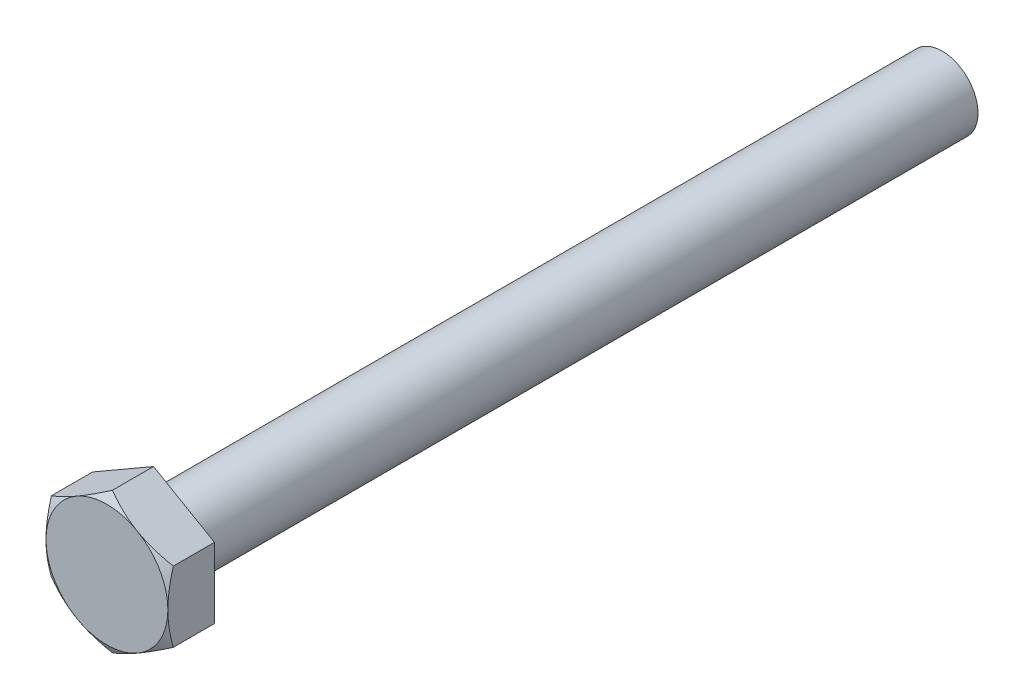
ISO-10303-21;
HEADER;
FILE_DESCRIPTION(('STEP AP214'),'2;1');
FILE_NAME('part.step','',(''),(''),'','','');
FILE_SCHEMA(('AUTOMOTIVE_DESIGN { 1 0 10303 214 1 1 1 1 }'));
ENDSEC;
DATA;
#1=APPLICATION_CONTEXT('core data for automotive mechanical design processes');
#2=APPLICATION_PROTOCOL_DEFINITION('international standard','automotive_design',2000,#1);
#3=PRODUCT_CONTEXT('',#1,'mechanical');
#4=PRODUCT('Part','Part','',(#3));
#5=PRODUCT_RELATED_PRODUCT_CATEGORY('part','',(#4));
#6=PRODUCT_DEFINITION_FORMATION('','',#4);
#7=PRODUCT_DEFINITION_CONTEXT('part definition',#1,'design');
#8=PRODUCT_DEFINITION('design','',#6,#7);
#9=PRODUCT_DEFINITION_SHAPE('','',#8);
#10=(LENGTH_UNIT() NAMED_UNIT(*) SI_UNIT(.MILLI.,.METRE.));
#11=(NAMED_UNIT(*) PLANE_ANGLE_UNIT() SI_UNIT($,.RADIAN.));
#12=(NAMED_UNIT(*) SI_UNIT($,.STERADIAN.) SOLID_ANGLE_UNIT());
#13=UNCERTAINTY_MEASURE_WITH_UNIT(LENGTH_MEASURE(1.E-05),#10,'distance_accuracy_value','');
#14=(GEOMETRIC_REPRESENTATION_CONTEXT(3) GLOBAL_UNCERTAINTY_ASSIGNED_CONTEXT((#13)) GLOBAL_UNIT_ASSIGNED_CONTEXT((#10,
#11,#12)) REPRESENTATION_CONTEXT('',''));
#15=CARTESIAN_POINT('',(0.,0.,0.));
#16=DIRECTION('',(0.,0.,1.));
#17=DIRECTION('',(1.,0.,0.));
#18=AXIS2_PLACEMENT_3D('',#15,#16,#17);
#19=CARTESIAN_POINT('',(0.,-19.6299091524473,123.));
#20=DIRECTION('',(-0.5,0.866025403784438,0.));
#21=DIRECTION('',(-0.866025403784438,-0.5,0.));
#22=AXIS2_PLACEMENT_3D('',#19,#20,#21);
#23=PLANE('',#22);
#24=CARTESIAN_POINT('',(-0.000200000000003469,-19.6300246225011,121.481554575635));
#25=CARTESIAN_POINT('',(0.373453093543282,-19.4142959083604,121.606097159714));
#26=CARTESIAN_POINT('',(0.748563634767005,-19.197725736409,121.724988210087));
#27=CARTESIAN_POINT('',(1.50179265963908,-18.7628487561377,121.949896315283));
#28=CARTESIAN_POINT('',(1.87991208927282,-18.5445414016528,122.055909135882));
#29=CARTESIAN_POINT('',(2.6398896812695,-18.1057681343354,122.253635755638));
#30=CARTESIAN_POINT('',(3.02175449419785,-17.8852983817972,122.345315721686));
#31=CARTESIAN_POINT('',(3.78813752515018,-17.4428269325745,122.512407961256));
#32=CARTESIAN_POINT('',(4.1726555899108,-17.2208253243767,122.587821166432));
#33=CARTESIAN_POINT('',(4.93449246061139,-16.7809786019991,122.719172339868));
#34=CARTESIAN_POINT('',(5.31175470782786,-16.5631661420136,122.775545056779));
#35=CARTESIAN_POINT('',(6.06800787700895,-16.1265431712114,122.870069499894));
#36=CARTESIAN_POINT('',(6.44699883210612,-15.9077326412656,122.908220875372));
#37=CARTESIAN_POINT('',(7.20561738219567,-15.4697440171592,122.965339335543));
#38=CARTESIAN_POINT('',(7.58524368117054,-15.2505666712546,122.984329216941));
#39=CARTESIAN_POINT('',(8.34484669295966,-14.8120096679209,123.002716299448));
#40=CARTESIAN_POINT('',(8.72482339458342,-14.5926300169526,123.002114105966));
#41=CARTESIAN_POINT('',(9.43519932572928,-14.1824942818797,122.982685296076));
#42=CARTESIAN_POINT('',(9.76564916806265,-13.9917089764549,122.96622784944));
#43=CARTESIAN_POINT('',(10.4257606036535,-13.6105934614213,122.918807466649));
#44=CARTESIAN_POINT('',(10.7554222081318,-13.4202632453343,122.887844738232));
#45=CARTESIAN_POINT('',(11.4138322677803,-13.0401300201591,122.811951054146));
#46=CARTESIAN_POINT('',(11.7425796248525,-12.8503276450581,122.76700746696));
#47=CARTESIAN_POINT('',(12.3985093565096,-12.4716264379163,122.663945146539));
#48=CARTESIAN_POINT('',(12.7256917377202,-12.2827276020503,122.605826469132));
#49=CARTESIAN_POINT('',(13.718896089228,-11.709300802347,122.410229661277));
#50=CARTESIAN_POINT('',(14.3820418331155,-11.3264334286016,122.253247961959));
#51=CARTESIAN_POINT('',(15.6984451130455,-10.5664076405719,121.89696389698));
#52=CARTESIAN_POINT('',(16.351719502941,-10.189239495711,121.697745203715));
#53=CARTESIAN_POINT('',(17.0002,-9.81483910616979,121.481554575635));
#54=B_SPLINE_CURVE_WITH_KNOTS('',3,(#24,#25,#26,#27,#28,#29,#30,#31,#32,#33,#34,#35,#36,#37,#38,
#39,#40,#41,#42,#43,#44,#45,#46,#47,#48,#49,#50,#51,#52,#53),.UNSPECIFIED.,.F.,.F.,(4,2,2,2,2,2,
2,2,2,2,2,2,2,2,4),(0.,1.34725361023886,2.6949489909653,4.04577911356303,5.3965318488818,
6.7139450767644,8.03138366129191,9.3472530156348,10.6630817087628,11.808581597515,
12.9540650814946,14.1005865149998,15.2471030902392,17.590639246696,19.929575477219),.UNSPECIFIED.);
#55=CARTESIAN_POINT('',(0.,-19.6299091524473,121.48162124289));
#56=VERTEX_POINT('',#55);
#57=CARTESIAN_POINT('',(8.50000000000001,-14.7224318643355,123.));
#58=VERTEX_POINT('',#57);
#59=EDGE_CURVE('E275',#56,#58,#54,.T.);
#60=ORIENTED_EDGE('',*,*,#59,.F.);
#61=DIRECTION('',(0.,0.,-1.));
#62=VECTOR('',#61,1.);
#63=CARTESIAN_POINT('',(0.,-19.6299091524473,123.));
#64=LINE('',#63,#62);
#65=CARTESIAN_POINT('',(0.,-19.6299091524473,110.));
#66=VERTEX_POINT('',#65);
#67=EDGE_CURVE('E258',#56,#66,#64,.T.);
#68=ORIENTED_EDGE('',*,*,#67,.T.);
#69=DIRECTION('',(0.866025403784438,0.5,0.));
#70=VECTOR('',#69,1.);
#71=CARTESIAN_POINT('',(0.,-19.6299091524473,110.));
#72=LINE('',#71,#70);
#73=CARTESIAN_POINT('',(17.,-9.81495457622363,110.));
#74=VERTEX_POINT('',#73);
#75=EDGE_CURVE('E273',#66,#74,#72,.T.);
#76=ORIENTED_EDGE('',*,*,#75,.T.);
#77=DIRECTION('',(0.,0.,-1.));
#78=VECTOR('',#77,1.);
#79=CARTESIAN_POINT('',(17.,-9.81495457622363,123.));
#80=LINE('',#79,#78);
#81=CARTESIAN_POINT('',(17.,-9.81495457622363,121.48162124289));
#82=VERTEX_POINT('',#81);
#83=EDGE_CURVE('E246',#82,#74,#80,.T.);
#84=ORIENTED_EDGE('',*,*,#83,.F.);
#85=EDGE_CURVE('E184',#58,#82,#54,.T.);
#86=ORIENTED_EDGE('',*,*,#85,.F.);
#87=EDGE_LOOP('',(#60,#68,#76,#84,#86));
#88=FACE_BOUND('',#87,.T.);
#89=ADVANCED_FACE('F55',(#88),#23,.F.);
#90=CARTESIAN_POINT('',(17.,-9.81495457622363,123.));
#91=DIRECTION('',(-1.,0.,0.));
#92=DIRECTION('',(0.,0.,1.));
#93=AXIS2_PLACEMENT_3D('',#90,#91,#92);
#94=PLANE('',#93);
#95=CARTESIAN_POINT('',(17.,-26.7280331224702,114.526636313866));
#96=CARTESIAN_POINT('',(17.,-26.3551833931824,114.708270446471));
#97=CARTESIAN_POINT('',(17.,-25.9819058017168,114.889025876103));
#98=CARTESIAN_POINT('',(17.,-25.2344057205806,115.248580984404));
#99=CARTESIAN_POINT('',(17.,-24.860183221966,115.427380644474));
#100=CARTESIAN_POINT('',(17.,-23.735869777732,115.960593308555));
#101=CARTESIAN_POINT('',(17.,-22.9842377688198,116.311768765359));
#102=CARTESIAN_POINT('',(17.,-21.4721452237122,117.005243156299));
#103=CARTESIAN_POINT('',(17.,-20.7116591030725,117.34748643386));
#104=CARTESIAN_POINT('',(17.,-19.1847639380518,118.018447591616));
#105=CARTESIAN_POINT('',(17.,-18.4183551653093,118.347166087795));
#106=CARTESIAN_POINT('',(17.,-16.8524945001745,118.998280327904));
#107=CARTESIAN_POINT('',(17.,-16.0527982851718,119.320091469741));
#108=CARTESIAN_POINT('',(17.,-14.4441803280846,119.940228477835));
#109=CARTESIAN_POINT('',(17.,-13.635257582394,120.23855176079));
#110=CARTESIAN_POINT('',(17.,-12.0083241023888,120.804143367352));
#111=CARTESIAN_POINT('',(17.,-11.1903343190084,121.071471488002));
#112=CARTESIAN_POINT('',(17.,-9.54255158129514,121.566753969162));
#113=CARTESIAN_POINT('',(17.,-8.71276231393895,121.794720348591));
#114=CARTESIAN_POINT('',(17.,-7.46131813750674,122.098467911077));
#115=CARTESIAN_POINT('',(17.,-7.04422239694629,122.193137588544));
#116=CARTESIAN_POINT('',(17.,-6.20711565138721,122.368644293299));
#117=CARTESIAN_POINT('',(17.,-5.78710470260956,122.449481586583));
#118=CARTESIAN_POINT('',(17.,-4.94443148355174,122.59591989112));
#119=CARTESIAN_POINT('',(17.,-4.52176927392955,122.661521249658));
#120=CARTESIAN_POINT('',(17.,-3.67421205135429,122.776193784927));
#121=CARTESIAN_POINT('',(17.,-3.24931713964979,122.825265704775));
#122=CARTESIAN_POINT('',(17.,-2.40359325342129,122.905268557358));
#123=CARTESIAN_POINT('',(17.,-1.98278671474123,122.936435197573));
#124=CARTESIAN_POINT('',(17.,-1.1402323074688,122.980929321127));
#125=CARTESIAN_POINT('',(17.,-0.718484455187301,122.994257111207));
#126=CARTESIAN_POINT('',(17.,0.125201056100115,123.00275460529));
#127=CARTESIAN_POINT('',(17.,0.547138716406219,122.997924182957));
#128=CARTESIAN_POINT('',(17.,1.39042569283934,122.970227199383));
#129=CARTESIAN_POINT('',(17.,1.81177498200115,122.947359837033));
#130=CARTESIAN_POINT('',(17.,2.81340815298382,122.872053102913));
#131=CARTESIAN_POINT('',(17.,3.39310826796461,122.811668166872));
#132=CARTESIAN_POINT('',(17.,4.54841596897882,122.659968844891));
#133=CARTESIAN_POINT('',(17.,5.12402303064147,122.568650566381));
#134=CARTESIAN_POINT('',(17.,6.84391206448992,122.253120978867));
#135=CARTESIAN_POINT('',(17.,7.98068827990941,121.987383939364));
#136=CARTESIAN_POINT('',(17.,9.68133337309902,121.523804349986));
#137=CARTESIAN_POINT('',(17.,10.2539418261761,121.35615677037));
#138=CARTESIAN_POINT('',(17.,11.393602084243,121.002767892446));
#139=CARTESIAN_POINT('',(17.,11.960653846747,120.817026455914));
#140=CARTESIAN_POINT('',(17.,13.0893763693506,120.430484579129));
#141=CARTESIAN_POINT('',(17.,13.6510486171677,120.229688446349));
#142=CARTESIAN_POINT('',(17.,14.4900257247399,119.919026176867));
#143=CARTESIAN_POINT('',(17.,14.7690947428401,119.813894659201));
#144=CARTESIAN_POINT('',(17.,15.3261263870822,119.600736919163));
#145=CARTESIAN_POINT('',(17.,15.6040890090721,119.492710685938));
#146=CARTESIAN_POINT('',(17.,16.3491524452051,119.199057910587));
#147=CARTESIAN_POINT('',(17.,16.8152948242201,119.010997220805));
#148=CARTESIAN_POINT('',(17.,17.7449138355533,118.628389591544));
#149=CARTESIAN_POINT('',(17.,18.2083904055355,118.433842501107));
#150=CARTESIAN_POINT('',(17.,19.5953089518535,117.841784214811));
#151=CARTESIAN_POINT('',(17.,20.5151724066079,117.43588285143));
#152=CARTESIAN_POINT('',(17.,22.3475546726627,116.607038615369));
#153=CARTESIAN_POINT('',(17.,23.260070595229,116.184089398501));
#154=CARTESIAN_POINT('',(17.,25.0788968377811,115.325172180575));
#155=CARTESIAN_POINT('',(17.,25.9852074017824,114.889204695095));
#156=CARTESIAN_POINT('',(17.,27.7942699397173,114.006378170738));
#157=CARTESIAN_POINT('',(17.,28.6970140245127,113.559503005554));
#158=CARTESIAN_POINT('',(17.,30.4984370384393,112.657627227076));
#159=CARTESIAN_POINT('',(17.,31.3971159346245,112.202626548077));
#160=CARTESIAN_POINT('',(17.,33.1909377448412,111.2861835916));
#161=CARTESIAN_POINT('',(17.,34.0860813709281,110.824742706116));
#162=CARTESIAN_POINT('',(17.,35.8735953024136,109.896531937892));
#163=CARTESIAN_POINT('',(17.,36.7659656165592,109.429762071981));
#164=CARTESIAN_POINT('',(17.,38.4550066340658,108.540964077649));
#165=CARTESIAN_POINT('',(17.,39.2519073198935,108.119372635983));
#166=CARTESIAN_POINT('',(17.,40.8441152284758,107.273190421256));
#167=CARTESIAN_POINT('',(17.,41.6394224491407,106.848599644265));
#168=CARTESIAN_POINT('',(17.,44.0233835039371,105.570947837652));
#169=CARTESIAN_POINT('',(17.,45.6099843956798,104.714056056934));
#170=CARTESIAN_POINT('',(17.,48.7737962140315,102.995511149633));
#171=CARTESIAN_POINT('',(17.,50.3510208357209,102.133883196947));
#172=CARTESIAN_POINT('',(17.,52.7143990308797,100.837107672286));
#173=CARTESIAN_POINT('',(17.,53.5017518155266,100.404143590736));
#174=CARTESIAN_POINT('',(17.,55.0757435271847,99.5369220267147));
#175=CARTESIAN_POINT('',(17.,55.8623824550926,99.1026645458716));
#176=CARTESIAN_POINT('',(17.,56.6487081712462,98.6678408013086));
#177=B_SPLINE_CURVE_WITH_KNOTS('',3,(#95,#96,#97,#98,#99,#100,#101,#102,#103,#104,#105,#106,
#107,#108,#109,#110,#111,#112,#113,#114,#115,#116,#117,#118,#119,#120,#121,#122,#123,#124,#125,
#126,#127,#128,#129,#130,#131,#132,#133,#134,#135,#136,#137,#138,#139,#140,#141,#142,#143,#144,
#145,#146,#147,#148,#149,#150,#151,#152,#153,#154,#155,#156,#157,#158,#159,#160,#161,#162,#163,
#164,#165,#166,#167,#168,#169,#170,#171,#172,#173,#174,#175,#176),.UNSPECIFIED.,.F.,.F.,(4,2,2,
2,2,2,2,2,2,2,2,2,2,2,2,2,2,2,2,2,2,2,2,2,2,2,2,2,2,2,2,2,2,2,2,2,2,2,2,2,4),(0.,
1.24421283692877,2.48843749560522,4.97723697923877,7.47897879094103,9.98060653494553,
12.5663811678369,15.1524398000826,17.7334232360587,20.3136171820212,21.5965386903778,
22.8794355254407,24.1623031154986,25.4451130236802,26.7106242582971,27.97611373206,
29.241612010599,30.507166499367,32.2546970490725,34.0024475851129,37.4996679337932,
39.2894449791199,41.0792356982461,42.8685162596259,43.7631470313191,44.6577811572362,
46.1656645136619,47.673582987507,50.6896374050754,53.7068247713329,56.7238928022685,
59.745729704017,62.767591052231,65.7888090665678,68.8100175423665,71.5146563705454,
74.2192987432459,79.6288966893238,85.0205755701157,87.7162081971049,90.4118374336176),.UNSPECIFIED.);
#178=CARTESIAN_POINT('',(17.,0.,123.));
#179=VERTEX_POINT('',#178);
#180=EDGE_CURVE('E278',#82,#179,#177,.T.);
#181=ORIENTED_EDGE('',*,*,#180,.F.);
#182=ORIENTED_EDGE('',*,*,#83,.T.);
#183=DIRECTION('',(0.,1.,0.));
#184=VECTOR('',#183,1.);
#185=CARTESIAN_POINT('',(17.,-9.81495457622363,110.));
#186=LINE('',#185,#184);
#187=CARTESIAN_POINT('',(17.,9.81495457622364,110.));
#188=VERTEX_POINT('',#187);
#189=EDGE_CURVE('E271',#74,#188,#186,.T.);
#190=ORIENTED_EDGE('',*,*,#189,.T.);
#191=DIRECTION('',(0.,0.,-1.));
#192=VECTOR('',#191,1.);
#193=CARTESIAN_POINT('',(17.,9.81495457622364,123.));
#194=LINE('',#193,#192);
#195=CARTESIAN_POINT('',(17.,9.81495457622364,121.48162124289));
#196=VERTEX_POINT('',#195);
#197=EDGE_CURVE('E249',#196,#188,#194,.T.);
#198=ORIENTED_EDGE('',*,*,#197,.F.);
#199=EDGE_CURVE('E131',#179,#196,#177,.T.);
#200=ORIENTED_EDGE('',*,*,#199,.F.);
#201=EDGE_LOOP('',(#181,#182,#190,#198,#200));
#202=FACE_BOUND('',#201,.T.);
#203=ADVANCED_FACE('F221',(#202),#94,.F.);
#204=CARTESIAN_POINT('',(17.,9.81495457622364,123.));
#205=DIRECTION('',(-0.5,-0.866025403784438,0.));
#206=DIRECTION('',(0.866025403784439,-0.5,0.));
#207=AXIS2_PLACEMENT_3D('',#204,#205,#206);
#208=PLANE('',#207);
#209=CARTESIAN_POINT('',(17.0002,9.8148391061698,121.481554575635));
#210=CARTESIAN_POINT('',(16.6265469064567,10.0305678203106,121.606097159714));
#211=CARTESIAN_POINT('',(16.251436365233,10.2471379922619,121.724988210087));
#212=CARTESIAN_POINT('',(15.4982073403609,10.6820149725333,121.949896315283));
#213=CARTESIAN_POINT('',(15.1200879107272,10.9003223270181,122.055909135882));
#214=CARTESIAN_POINT('',(14.3601103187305,11.3390955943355,122.253635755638));
#215=CARTESIAN_POINT('',(13.9782455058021,11.5595653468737,122.345315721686));
#216=CARTESIAN_POINT('',(13.2118624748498,12.0020367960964,122.512407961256));
#217=CARTESIAN_POINT('',(12.8273444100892,12.2240384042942,122.587821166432));
#218=CARTESIAN_POINT('',(12.0655075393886,12.6638851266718,122.719172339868));
#219=CARTESIAN_POINT('',(11.6882452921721,12.8816975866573,122.775545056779));
#220=CARTESIAN_POINT('',(10.931992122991,13.3183205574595,122.870069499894));
#221=CARTESIAN_POINT('',(10.5530011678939,13.5371310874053,122.908220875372));
#222=CARTESIAN_POINT('',(9.79438261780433,13.9751197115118,122.965339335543));
#223=CARTESIAN_POINT('',(9.41475631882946,14.1942970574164,122.984329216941));
#224=CARTESIAN_POINT('',(8.65515330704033,14.6328540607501,123.002716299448));
#225=CARTESIAN_POINT('',(8.27517660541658,14.8522337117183,123.002114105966));
#226=CARTESIAN_POINT('',(7.56480067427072,15.2623694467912,122.982685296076));
#227=CARTESIAN_POINT('',(7.23435083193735,15.4531547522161,122.96622784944));
#228=CARTESIAN_POINT('',(6.57423939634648,15.8342702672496,122.918807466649));
#229=CARTESIAN_POINT('',(6.2445777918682,16.0246004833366,122.887844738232));
#230=CARTESIAN_POINT('',(5.58616773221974,16.4047337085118,122.811951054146));
#231=CARTESIAN_POINT('',(5.25742037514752,16.5945360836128,122.76700746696));
#232=CARTESIAN_POINT('',(4.60149064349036,16.9732372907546,122.663945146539));
#233=CARTESIAN_POINT('',(4.27430826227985,17.1621361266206,122.605826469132));
#234=CARTESIAN_POINT('',(3.281103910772,17.7355629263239,122.410229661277));
#235=CARTESIAN_POINT('',(2.61795816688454,18.1184303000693,122.253247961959));
#236=CARTESIAN_POINT('',(1.30155488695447,18.878456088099,121.89696389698));
#237=CARTESIAN_POINT('',(0.648280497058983,19.2556242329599,121.697745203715));
#238=CARTESIAN_POINT('',(-0.000199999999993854,19.6300246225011,121.481554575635));
#239=B_SPLINE_CURVE_WITH_KNOTS('',3,(#209,#210,#211,#212,#213,#214,#215,#216,#217,#218,#219,
#220,#221,#222,#223,#224,#225,#226,#227,#228,#229,#230,#231,#232,#233,#234,#235,#236,#237,#238),
.UNSPECIFIED.,.F.,.F.,(4,2,2,2,2,2,2,2,2,2,2,2,2,2,4),(0.,1.34725361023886,2.6949489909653,
4.04577911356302,5.39653184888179,6.71394507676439,8.03138366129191,9.3472530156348,
10.6630817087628,11.808581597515,12.9540650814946,14.1005865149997,15.2471030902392,
17.590639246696,19.929575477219),.UNSPECIFIED.);
#240=CARTESIAN_POINT('',(8.5,14.7224318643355,123.));
#241=VERTEX_POINT('',#240);
#242=EDGE_CURVE('E127',#196,#241,#239,.T.);
#243=ORIENTED_EDGE('',*,*,#242,.F.);
#244=ORIENTED_EDGE('',*,*,#197,.T.);
#245=DIRECTION('',(-0.866025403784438,0.5,0.));
#246=VECTOR('',#245,1.);
#247=CARTESIAN_POINT('',(17.,9.81495457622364,110.));
#248=LINE('',#247,#246);
#249=CARTESIAN_POINT('',(0.,19.6299091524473,110.));
#250=VERTEX_POINT('',#249);
#251=EDGE_CURVE('E269',#188,#250,#248,.T.);
#252=ORIENTED_EDGE('',*,*,#251,.T.);
#253=DIRECTION('',(0.,0.,-1.));
#254=VECTOR('',#253,1.);
#255=CARTESIAN_POINT('',(0.,19.6299091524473,123.));
#256=LINE('',#255,#254);
#257=CARTESIAN_POINT('',(0.,19.6299091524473,121.48162124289));
#258=VERTEX_POINT('',#257);
#259=EDGE_CURVE('E151',#258,#250,#256,.T.);
#260=ORIENTED_EDGE('',*,*,#259,.F.);
#261=EDGE_CURVE('E135',#241,#258,#239,.T.);
#262=ORIENTED_EDGE('',*,*,#261,.F.);
#263=EDGE_LOOP('',(#243,#244,#252,#260,#262));
#264=FACE_BOUND('',#263,.T.);
#265=ADVANCED_FACE('F149',(#264),#208,.F.);
#266=CARTESIAN_POINT('',(0.,19.6299091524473,123.));
#267=DIRECTION('',(0.5,-0.866025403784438,0.));
#268=DIRECTION('',(0.866025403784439,0.5,0.));
#269=AXIS2_PLACEMENT_3D('',#266,#267,#268);
#270=PLANE('',#269);
#271=CARTESIAN_POINT('',(0.000200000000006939,19.6300246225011,121.481554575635));
#272=CARTESIAN_POINT('',(-0.37345309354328,19.4142959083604,121.606097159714));
#273=CARTESIAN_POINT('',(-0.748563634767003,19.197725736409,121.724988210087));
#274=CARTESIAN_POINT('',(-1.50179265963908,18.7628487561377,121.949896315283));
#275=CARTESIAN_POINT('',(-1.87991208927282,18.5445414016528,122.055909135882));
#276=CARTESIAN_POINT('',(-2.6398896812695,18.1057681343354,122.253635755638));
#277=CARTESIAN_POINT('',(-3.02175449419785,17.8852983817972,122.345315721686));
#278=CARTESIAN_POINT('',(-3.78813752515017,17.4428269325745,122.512407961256));
#279=CARTESIAN_POINT('',(-4.17265558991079,17.2208253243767,122.587821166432));
#280=CARTESIAN_POINT('',(-4.93449246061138,16.7809786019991,122.719172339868));
#281=CARTESIAN_POINT('',(-5.31175470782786,16.5631661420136,122.77554505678));
#282=CARTESIAN_POINT('',(-6.06800787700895,16.1265431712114,122.870069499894));
#283=CARTESIAN_POINT('',(-6.44699883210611,15.9077326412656,122.908220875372));
#284=CARTESIAN_POINT('',(-7.20561738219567,15.4697440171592,122.965339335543));
#285=CARTESIAN_POINT('',(-7.58524368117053,15.2505666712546,122.984329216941));
#286=CARTESIAN_POINT('',(-8.34484669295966,14.8120096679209,123.002716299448));
#287=CARTESIAN_POINT('',(-8.72482339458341,14.5926300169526,123.002114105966));
#288=CARTESIAN_POINT('',(-9.43519932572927,14.1824942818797,122.982685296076));
#289=CARTESIAN_POINT('',(-9.76564916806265,13.9917089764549,122.96622784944));
#290=CARTESIAN_POINT('',(-10.4257606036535,13.6105934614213,122.918807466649));
#291=CARTESIAN_POINT('',(-10.7554222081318,13.4202632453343,122.887844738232));
#292=CARTESIAN_POINT('',(-11.4138322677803,13.0401300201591,122.811951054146));
#293=CARTESIAN_POINT('',(-11.7425796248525,12.8503276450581,122.76700746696));
#294=CARTESIAN_POINT('',(-12.3985093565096,12.4716264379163,122.663945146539));
#295=CARTESIAN_POINT('',(-12.7256917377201,12.2827276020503,122.605826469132));
#296=CARTESIAN_POINT('',(-13.718896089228,11.709300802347,122.410229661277));
#297=CARTESIAN_POINT('',(-14.3820418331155,11.3264334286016,122.253247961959));
#298=CARTESIAN_POINT('',(-15.6984451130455,10.5664076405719,121.89696389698));
#299=CARTESIAN_POINT('',(-16.351719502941,10.189239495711,121.697745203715));
#300=CARTESIAN_POINT('',(-17.0002,9.81483910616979,121.481554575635));
#301=B_SPLINE_CURVE_WITH_KNOTS('',3,(#271,#272,#273,#274,#275,#276,#277,#278,#279,#280,#281,
#282,#283,#284,#285,#286,#287,#288,#289,#290,#291,#292,#293,#294,#295,#296,#297,#298,#299,#300),
.UNSPECIFIED.,.F.,.F.,(4,2,2,2,2,2,2,2,2,2,2,2,2,2,4),(0.,1.34725361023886,2.6949489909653,
4.04577911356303,5.3965318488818,6.71394507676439,8.03138366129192,9.3472530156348,
10.6630817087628,11.808581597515,12.9540650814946,14.1005865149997,15.2471030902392,
17.590639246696,19.929575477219),.UNSPECIFIED.);
#302=CARTESIAN_POINT('',(-8.50000000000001,14.7224318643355,123.));
#303=VERTEX_POINT('',#302);
#304=EDGE_CURVE('E140',#258,#303,#301,.T.);
#305=ORIENTED_EDGE('',*,*,#304,.F.);
#306=ORIENTED_EDGE('',*,*,#259,.T.);
#307=DIRECTION('',(-0.866025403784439,-0.5,0.));
#308=VECTOR('',#307,1.);
#309=CARTESIAN_POINT('',(0.,19.6299091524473,110.));
#310=LINE('',#309,#308);
#311=CARTESIAN_POINT('',(-17.,9.81495457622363,110.));
#312=VERTEX_POINT('',#311);
#313=EDGE_CURVE('E266',#250,#312,#310,.T.);
#314=ORIENTED_EDGE('',*,*,#313,.T.);
#315=DIRECTION('',(0.,0.,-1.));
#316=VECTOR('',#315,1.);
#317=CARTESIAN_POINT('',(-17.,9.81495457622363,123.));
#318=LINE('',#317,#316);
#319=CARTESIAN_POINT('',(-17.,9.81495457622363,121.48162124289));
#320=VERTEX_POINT('',#319);
#321=EDGE_CURVE('E254',#320,#312,#318,.T.);
#322=ORIENTED_EDGE('',*,*,#321,.F.);
#323=EDGE_CURVE('E152',#303,#320,#301,.T.);
#324=ORIENTED_EDGE('',*,*,#323,.F.);
#325=EDGE_LOOP('',(#305,#306,#314,#322,#324));
#326=FACE_BOUND('',#325,.T.);
#327=ADVANCED_FACE('F212',(#326),#270,.F.);
#328=CARTESIAN_POINT('',(-17.,9.81495457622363,123.));
#329=DIRECTION('',(1.,0.,0.));
#330=DIRECTION('',(0.,1.,0.));
#331=AXIS2_PLACEMENT_3D('',#328,#329,#330);
#332=PLANE('',#331);
#333=CARTESIAN_POINT('',(-17.,-26.7280331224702,114.526636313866));
#334=CARTESIAN_POINT('',(-17.,-26.3551833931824,114.708270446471));
#335=CARTESIAN_POINT('',(-17.,-25.9819058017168,114.889025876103));
#336=CARTESIAN_POINT('',(-17.,-25.2344057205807,115.248580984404));
#337=CARTESIAN_POINT('',(-17.,-24.860183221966,115.427380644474));
#338=CARTESIAN_POINT('',(-17.,-23.735869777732,115.960593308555));
#339=CARTESIAN_POINT('',(-17.,-22.9842377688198,116.311768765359));
#340=CARTESIAN_POINT('',(-17.,-21.4721452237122,117.005243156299));
#341=CARTESIAN_POINT('',(-17.,-20.7116591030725,117.347486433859));
#342=CARTESIAN_POINT('',(-17.,-19.1847639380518,118.018447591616));
#343=CARTESIAN_POINT('',(-17.,-18.4183551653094,118.347166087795));
#344=CARTESIAN_POINT('',(-17.,-16.8524945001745,118.998280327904));
#345=CARTESIAN_POINT('',(-17.,-16.0527982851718,119.320091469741));
#346=CARTESIAN_POINT('',(-17.,-14.4441803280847,119.940228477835));
#347=CARTESIAN_POINT('',(-17.,-13.635257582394,120.23855176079));
#348=CARTESIAN_POINT('',(-17.,-12.0083241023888,120.804143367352));
#349=CARTESIAN_POINT('',(-17.,-11.1903343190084,121.071471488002));
#350=CARTESIAN_POINT('',(-17.,-9.54255158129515,121.566753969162));
#351=CARTESIAN_POINT('',(-17.,-8.71276231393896,121.794720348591));
#352=CARTESIAN_POINT('',(-17.,-7.46131813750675,122.098467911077));
#353=CARTESIAN_POINT('',(-17.,-7.04422239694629,122.193137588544));
#354=CARTESIAN_POINT('',(-17.,-6.20711565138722,122.368644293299));
#355=CARTESIAN_POINT('',(-17.,-5.78710470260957,122.449481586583));
#356=CARTESIAN_POINT('',(-17.,-4.94443148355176,122.59591989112));
#357=CARTESIAN_POINT('',(-17.,-4.52176927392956,122.661521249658));
#358=CARTESIAN_POINT('',(-17.,-3.67421205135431,122.776193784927));
#359=CARTESIAN_POINT('',(-17.,-3.2493171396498,122.825265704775));
#360=CARTESIAN_POINT('',(-17.,-2.40359325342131,122.905268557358));
#361=CARTESIAN_POINT('',(-17.,-1.98278671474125,122.936435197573));
#362=CARTESIAN_POINT('',(-17.,-1.14023230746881,122.980929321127));
#363=CARTESIAN_POINT('',(-17.,-0.718484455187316,122.994257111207));
#364=CARTESIAN_POINT('',(-17.,0.125201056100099,123.00275460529));
#365=CARTESIAN_POINT('',(-17.,0.547138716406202,122.997924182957));
#366=CARTESIAN_POINT('',(-17.,1.39042569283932,122.970227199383));
#367=CARTESIAN_POINT('',(-17.,1.81177498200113,122.947359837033));
#368=CARTESIAN_POINT('',(-17.,2.8134081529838,122.872053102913));
#369=CARTESIAN_POINT('',(-17.,3.39310826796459,122.811668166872));
#370=CARTESIAN_POINT('',(-17.,4.5484159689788,122.659968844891));
#371=CARTESIAN_POINT('',(-17.,5.12402303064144,122.568650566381));
#372=CARTESIAN_POINT('',(-17.,6.84391206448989,122.253120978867));
#373=CARTESIAN_POINT('',(-17.,7.98068827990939,121.987383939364));
#374=CARTESIAN_POINT('',(-17.,9.68133337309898,121.523804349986));
#375=CARTESIAN_POINT('',(-17.,10.2539418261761,121.35615677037));
#376=CARTESIAN_POINT('',(-17.,11.393602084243,121.002767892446));
#377=CARTESIAN_POINT('',(-17.,11.9606538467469,120.817026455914));
#378=CARTESIAN_POINT('',(-17.,13.0893763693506,120.430484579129));
#379=CARTESIAN_POINT('',(-17.,13.6510486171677,120.229688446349));
#380=CARTESIAN_POINT('',(-17.,14.4900257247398,119.919026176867));
#381=CARTESIAN_POINT('',(-17.,14.76909474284,119.813894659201));
#382=CARTESIAN_POINT('',(-17.,15.3261263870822,119.600736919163));
#383=CARTESIAN_POINT('',(-17.,15.6040890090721,119.492710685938));
#384=CARTESIAN_POINT('',(-17.,16.3491524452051,119.199057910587));
#385=CARTESIAN_POINT('',(-17.,16.8152948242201,119.010997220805));
#386=CARTESIAN_POINT('',(-17.,17.7449138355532,118.628389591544));
#387=CARTESIAN_POINT('',(-17.,18.2083904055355,118.433842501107));
#388=CARTESIAN_POINT('',(-17.,19.5953089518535,117.841784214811));
#389=CARTESIAN_POINT('',(-17.,20.5151724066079,117.43588285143));
#390=CARTESIAN_POINT('',(-17.,22.3475546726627,116.607038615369));
#391=CARTESIAN_POINT('',(-17.,23.2600705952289,116.184089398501));
#392=CARTESIAN_POINT('',(-17.,25.078896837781,115.325172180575));
#393=CARTESIAN_POINT('',(-17.,25.9852074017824,114.889204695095));
#394=CARTESIAN_POINT('',(-17.,27.7942699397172,114.006378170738));
#395=CARTESIAN_POINT('',(-17.,28.6970140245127,113.559503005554));
#396=CARTESIAN_POINT('',(-17.,30.4984370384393,112.657627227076));
#397=CARTESIAN_POINT('',(-17.,31.3971159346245,112.202626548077));
#398=CARTESIAN_POINT('',(-17.,33.1909377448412,111.2861835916));
#399=CARTESIAN_POINT('',(-17.,34.0860813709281,110.824742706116));
#400=CARTESIAN_POINT('',(-17.,35.8735953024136,109.896531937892));
#401=CARTESIAN_POINT('',(-17.,36.7659656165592,109.429762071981));
#402=CARTESIAN_POINT('',(-17.,38.4550066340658,108.540964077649));
#403=CARTESIAN_POINT('',(-17.,39.2519073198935,108.119372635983));
#404=CARTESIAN_POINT('',(-17.,40.8441152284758,107.273190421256));
#405=CARTESIAN_POINT('',(-17.,41.6394224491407,106.848599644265));
#406=CARTESIAN_POINT('',(-17.,44.0233835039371,105.570947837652));
#407=CARTESIAN_POINT('',(-17.,45.6099843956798,104.714056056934));
#408=CARTESIAN_POINT('',(-17.,48.7737962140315,102.995511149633));
#409=CARTESIAN_POINT('',(-17.,50.3510208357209,102.133883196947));
#410=CARTESIAN_POINT('',(-17.,52.7143990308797,100.837107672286));
#411=CARTESIAN_POINT('',(-17.,53.5017518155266,100.404143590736));
#412=CARTESIAN_POINT('',(-17.,55.0757435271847,99.5369220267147));
#413=CARTESIAN_POINT('',(-17.,55.8623824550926,99.1026645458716));
#414=CARTESIAN_POINT('',(-17.,56.6487081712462,98.6678408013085));
#415=B_SPLINE_CURVE_WITH_KNOTS('',3,(#333,#334,#335,#336,#337,#338,#339,#340,#341,#342,#343,
#344,#345,#346,#347,#348,#349,#350,#351,#352,#353,#354,#355,#356,#357,#358,#359,#360,#361,#362,
#363,#364,#365,#366,#367,#368,#369,#370,#371,#372,#373,#374,#375,#376,#377,#378,#379,#380,#381,
#382,#383,#384,#385,#386,#387,#388,#389,#390,#391,#392,#393,#394,#395,#396,#397,#398,#399,#400,
#401,#402,#403,#404,#405,#406,#407,#408,#409,#410,#411,#412,#413,#414),.UNSPECIFIED.,.F.,.F.,(4,
2,2,2,2,2,2,2,2,2,2,2,2,2,2,2,2,2,2,2,2,2,2,2,2,2,2,2,2,2,2,2,2,2,2,2,2,2,2,2,4),(0.,
1.24421283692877,2.48843749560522,4.97723697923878,7.47897879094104,9.98060653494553,
12.5663811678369,15.1524398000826,17.7334232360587,20.3136171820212,21.5965386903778,
22.8794355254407,24.1623031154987,25.4451130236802,26.7106242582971,27.97611373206,
29.241612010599,30.507166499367,32.2546970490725,34.0024475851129,37.4996679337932,
39.2894449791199,41.0792356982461,42.8685162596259,43.7631470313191,44.6577811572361,
46.1656645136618,47.673582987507,50.6896374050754,53.7068247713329,56.7238928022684,
59.7457297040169,62.767591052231,65.7888090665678,68.8100175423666,71.5146563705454,
74.2192987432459,79.6288966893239,85.0205755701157,87.7162081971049,90.4118374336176),.UNSPECIFIED.);
#416=CARTESIAN_POINT('',(-17.,0.,123.));
#417=VERTEX_POINT('',#416);
#418=EDGE_CURVE('E206',#320,#417,#415,.F.);
#419=ORIENTED_EDGE('',*,*,#418,.F.);
#420=ORIENTED_EDGE('',*,*,#321,.T.);
#421=DIRECTION('',(0.,-1.,0.));
#422=VECTOR('',#421,1.);
#423=CARTESIAN_POINT('',(-17.,9.81495457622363,110.));
#424=LINE('',#423,#422);
#425=CARTESIAN_POINT('',(-17.,-9.81495457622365,110.));
#426=VERTEX_POINT('',#425);
#427=EDGE_CURVE('E263',#312,#426,#424,.T.);
#428=ORIENTED_EDGE('',*,*,#427,.T.);
#429=DIRECTION('',(0.,0.,-1.));
#430=VECTOR('',#429,1.);
#431=CARTESIAN_POINT('',(-17.,-9.81495457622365,123.));
#432=LINE('',#431,#430);
#433=CARTESIAN_POINT('',(-17.,-9.81495457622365,121.48162124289));
#434=VERTEX_POINT('',#433);
#435=EDGE_CURVE('E256',#434,#426,#432,.T.);
#436=ORIENTED_EDGE('',*,*,#435,.F.);
#437=EDGE_CURVE('E200',#417,#434,#415,.F.);
#438=ORIENTED_EDGE('',*,*,#437,.F.);
#439=EDGE_LOOP('',(#419,#420,#428,#436,#438));
#440=FACE_BOUND('',#439,.T.);
#441=ADVANCED_FACE('F208',(#440),#332,.F.);
#442=CARTESIAN_POINT('',(-17.,-9.81495457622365,123.));
#443=DIRECTION('',(0.5,0.866025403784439,0.));
#444=DIRECTION('',(-0.866025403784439,0.5,0.));
#445=AXIS2_PLACEMENT_3D('',#442,#443,#444);
#446=PLANE('',#445);
#447=CARTESIAN_POINT('',(-17.0002,-9.81483910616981,121.481554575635));
#448=CARTESIAN_POINT('',(-16.6265469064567,-10.0305678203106,121.606097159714));
#449=CARTESIAN_POINT('',(-16.251436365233,-10.2471379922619,121.724988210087));
#450=CARTESIAN_POINT('',(-15.4982073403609,-10.6820149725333,121.949896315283));
#451=CARTESIAN_POINT('',(-15.1200879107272,-10.9003223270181,122.055909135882));
#452=CARTESIAN_POINT('',(-14.3601103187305,-11.3390955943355,122.253635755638));
#453=CARTESIAN_POINT('',(-13.9782455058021,-11.5595653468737,122.345315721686));
#454=CARTESIAN_POINT('',(-13.2118624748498,-12.0020367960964,122.512407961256));
#455=CARTESIAN_POINT('',(-12.8273444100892,-12.2240384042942,122.587821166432));
#456=CARTESIAN_POINT('',(-12.0655075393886,-12.6638851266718,122.719172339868));
#457=CARTESIAN_POINT('',(-11.6882452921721,-12.8816975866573,122.775545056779));
#458=CARTESIAN_POINT('',(-10.931992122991,-13.3183205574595,122.870069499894));
#459=CARTESIAN_POINT('',(-10.5530011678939,-13.5371310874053,122.908220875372));
#460=CARTESIAN_POINT('',(-9.79438261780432,-13.9751197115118,122.965339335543));
#461=CARTESIAN_POINT('',(-9.41475631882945,-14.1942970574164,122.984329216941));
#462=CARTESIAN_POINT('',(-8.65515330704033,-14.6328540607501,123.002716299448));
#463=CARTESIAN_POINT('',(-8.27517660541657,-14.8522337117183,123.002114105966));
#464=CARTESIAN_POINT('',(-7.56480067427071,-15.2623694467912,122.982685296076));
#465=CARTESIAN_POINT('',(-7.23435083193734,-15.4531547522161,122.96622784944));
#466=CARTESIAN_POINT('',(-6.57423939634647,-15.8342702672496,122.918807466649));
#467=CARTESIAN_POINT('',(-6.24457779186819,-16.0246004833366,122.887844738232));
#468=CARTESIAN_POINT('',(-5.58616773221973,-16.4047337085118,122.811951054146));
#469=CARTESIAN_POINT('',(-5.25742037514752,-16.5945360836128,122.76700746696));
#470=CARTESIAN_POINT('',(-4.60149064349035,-16.9732372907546,122.663945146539));
#471=CARTESIAN_POINT('',(-4.27430826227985,-17.1621361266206,122.605826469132));
#472=CARTESIAN_POINT('',(-3.281103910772,-17.7355629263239,122.410229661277));
#473=CARTESIAN_POINT('',(-2.61795816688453,-18.1184303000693,122.253247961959));
#474=CARTESIAN_POINT('',(-1.30155488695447,-18.878456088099,121.89696389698));
#475=CARTESIAN_POINT('',(-0.64828049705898,-19.2556242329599,121.697745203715));
#476=CARTESIAN_POINT('',(0.00019999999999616,-19.6300246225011,121.481554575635));
#477=B_SPLINE_CURVE_WITH_KNOTS('',3,(#447,#448,#449,#450,#451,#452,#453,#454,#455,#456,#457,
#458,#459,#460,#461,#462,#463,#464,#465,#466,#467,#468,#469,#470,#471,#472,#473,#474,#475,#476),
.UNSPECIFIED.,.F.,.F.,(4,2,2,2,2,2,2,2,2,2,2,2,2,2,4),(0.,1.34725361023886,2.6949489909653,
4.04577911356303,5.39653184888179,6.71394507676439,8.03138366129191,9.3472530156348,
10.6630817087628,11.808581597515,12.9540650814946,14.1005865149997,15.2471030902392,
17.590639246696,19.929575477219),.UNSPECIFIED.);
#478=CARTESIAN_POINT('',(-8.5,-14.7224318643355,123.));
#479=VERTEX_POINT('',#478);
#480=EDGE_CURVE('E207',#434,#479,#477,.T.);
#481=ORIENTED_EDGE('',*,*,#480,.F.);
#482=ORIENTED_EDGE('',*,*,#435,.T.);
#483=DIRECTION('',(0.866025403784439,-0.5,0.));
#484=VECTOR('',#483,1.);
#485=CARTESIAN_POINT('',(-17.,-9.81495457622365,110.));
#486=LINE('',#485,#484);
#487=EDGE_CURVE('E260',#426,#66,#486,.T.);
#488=ORIENTED_EDGE('',*,*,#487,.T.);
#489=ORIENTED_EDGE('',*,*,#67,.F.);
#490=EDGE_CURVE('E146',#479,#56,#477,.T.);
#491=ORIENTED_EDGE('',*,*,#490,.F.);
#492=EDGE_LOOP('',(#481,#482,#488,#489,#491));
#493=FACE_BOUND('',#492,.T.);
#494=ADVANCED_FACE('F211',(#493),#446,.F.);
#495=CARTESIAN_POINT('',(0.,0.,110.));
#496=DIRECTION('',(0.,0.,-1.));
#497=DIRECTION('',(-1.,0.,0.));
#498=AXIS2_PLACEMENT_3D('',#495,#496,#497);
#499=CYLINDRICAL_SURFACE('',#498,10.);
#500=CARTESIAN_POINT('',(0.,0.,110.));
#501=DIRECTION('',(0.,0.,1.));
#502=DIRECTION('',(1.,0.,0.));
#503=AXIS2_PLACEMENT_3D('',#500,#501,#502);
#504=CIRCLE('',#503,10.);
#505=CARTESIAN_POINT('',(10.,0.,110.));
#506=VERTEX_POINT('',#505);
#507=EDGE_CURVE('E245',#506,#506,#504,.T.);
#508=ORIENTED_EDGE('',*,*,#507,.F.);
#509=EDGE_LOOP('',(#508));
#510=FACE_BOUND('',#509,.T.);
#511=CARTESIAN_POINT('',(0.,0.,-110.));
#512=DIRECTION('',(0.,0.,1.));
#513=DIRECTION('',(1.,0.,0.));
#514=AXIS2_PLACEMENT_3D('',#511,#512,#513);
#515=CIRCLE('',#514,10.);
#516=CARTESIAN_POINT('',(10.,0.,-110.));
#517=VERTEX_POINT('',#516);
#518=EDGE_CURVE('E243',#517,#517,#515,.T.);
#519=ORIENTED_EDGE('',*,*,#518,.T.);
#520=EDGE_LOOP('',(#519));
#521=FACE_BOUND('',#520,.T.);
#522=ADVANCED_FACE('F57',(#510,#521),#499,.T.);
#523=CARTESIAN_POINT('',(0.,0.,-110.));
#524=DIRECTION('',(0.,0.,1.));
#525=DIRECTION('',(1.,0.,0.));
#526=AXIS2_PLACEMENT_3D('',#523,#524,#525);
#527=PLANE('',#526);
#528=ORIENTED_EDGE('',*,*,#518,.F.);
#529=EDGE_LOOP('',(#528));
#530=FACE_BOUND('',#529,.T.);
#531=ADVANCED_FACE('F231',(#530),#527,.F.);
#532=CARTESIAN_POINT('',(0.,0.,110.));
#533=DIRECTION('',(0.,0.,1.));
#534=DIRECTION('',(1.,0.,0.));
#535=AXIS2_PLACEMENT_3D('',#532,#533,#534);
#536=PLANE('',#535);
#537=ORIENTED_EDGE('',*,*,#507,.T.);
#538=EDGE_LOOP('',(#537));
#539=FACE_BOUND('',#538,.T.);
#540=ORIENTED_EDGE('',*,*,#75,.F.);
#541=ORIENTED_EDGE('',*,*,#487,.F.);
#542=ORIENTED_EDGE('',*,*,#427,.F.);
#543=ORIENTED_EDGE('',*,*,#313,.F.);
#544=ORIENTED_EDGE('',*,*,#251,.F.);
#545=ORIENTED_EDGE('',*,*,#189,.F.);
#546=EDGE_LOOP('',(#540,#541,#542,#543,#544,#545));
#547=FACE_BOUND('',#546,.T.);
#548=ADVANCED_FACE('F233',(#539,#547),#536,.F.);
#549=CARTESIAN_POINT('',(0.,0.,123.));
#550=DIRECTION('',(0.,0.,-1.));
#551=DIRECTION('',(1.,0.,0.));
#552=AXIS2_PLACEMENT_3D('',#549,#550,#551);
#553=CONICAL_SURFACE('',#552,17.,1.0471975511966);
#554=ORIENTED_EDGE('',*,*,#85,.T.);
#555=ORIENTED_EDGE('',*,*,#180,.T.);
#556=CARTESIAN_POINT('',(0.,0.,123.));
#557=DIRECTION('',(0.,0.,1.));
#558=DIRECTION('',(1.,0.,0.));
#559=AXIS2_PLACEMENT_3D('',#556,#557,#558);
#560=CIRCLE('',#559,17.);
#561=EDGE_CURVE('E59',#58,#179,#560,.T.);
#562=ORIENTED_EDGE('',*,*,#561,.F.);
#563=EDGE_LOOP('',(#554,#555,#562));
#564=FACE_BOUND('',#563,.T.);
#565=ADVANCED_FACE('F179',(#564),#553,.T.);
#566=ORIENTED_EDGE('',*,*,#59,.T.);
#567=EDGE_CURVE('E300',#479,#58,#560,.T.);
#568=ORIENTED_EDGE('',*,*,#567,.F.);
#569=ORIENTED_EDGE('',*,*,#490,.T.);
#570=EDGE_LOOP('',(#566,#568,#569));
#571=FACE_BOUND('',#570,.T.);
#572=ADVANCED_FACE('F174',(#571),#553,.T.);
#573=ORIENTED_EDGE('',*,*,#437,.T.);
#574=ORIENTED_EDGE('',*,*,#480,.T.);
#575=EDGE_CURVE('E79',#417,#479,#560,.T.);
#576=ORIENTED_EDGE('',*,*,#575,.F.);
#577=EDGE_LOOP('',(#573,#574,#576));
#578=FACE_BOUND('',#577,.T.);
#579=ADVANCED_FACE('F178',(#578),#553,.T.);
#580=ORIENTED_EDGE('',*,*,#323,.T.);
#581=ORIENTED_EDGE('',*,*,#418,.T.);
#582=EDGE_CURVE('E64',#303,#417,#560,.T.);
#583=ORIENTED_EDGE('',*,*,#582,.F.);
#584=EDGE_LOOP('',(#580,#581,#583));
#585=FACE_BOUND('',#584,.T.);
#586=ADVANCED_FACE('F296',(#585),#553,.T.);
#587=ORIENTED_EDGE('',*,*,#261,.T.);
#588=ORIENTED_EDGE('',*,*,#304,.T.);
#589=EDGE_CURVE('E13',#241,#303,#560,.T.);
#590=ORIENTED_EDGE('',*,*,#589,.F.);
#591=EDGE_LOOP('',(#587,#588,#590));
#592=FACE_BOUND('',#591,.T.);
#593=ADVANCED_FACE('F138',(#592),#553,.T.);
#594=ORIENTED_EDGE('',*,*,#199,.T.);
#595=ORIENTED_EDGE('',*,*,#242,.T.);
#596=CARTESIAN_POINT('',(0.,0.,123.));
#597=DIRECTION('',(0.,0.,1.));
#598=DIRECTION('',(1.,0.,0.));
#599=AXIS2_PLACEMENT_3D('',#596,#597,#598);
#600=CIRCLE('',#599,17.);
#601=EDGE_CURVE('E71',#179,#241,#600,.T.);
#602=ORIENTED_EDGE('',*,*,#601,.F.);
#603=EDGE_LOOP('',(#594,#595,#602));
#604=FACE_BOUND('',#603,.T.);
#605=ADVANCED_FACE('F129',(#604),#553,.T.);
#606=CARTESIAN_POINT('',(0.,0.,123.));
#607=DIRECTION('',(0.,0.,1.));
#608=DIRECTION('',(1.,0.,0.));
#609=AXIS2_PLACEMENT_3D('',#606,#607,#608);
#610=PLANE('',#609);
#611=ORIENTED_EDGE('',*,*,#561,.T.);
#612=ORIENTED_EDGE('',*,*,#601,.T.);
#613=ORIENTED_EDGE('',*,*,#589,.T.);
#614=ORIENTED_EDGE('',*,*,#582,.T.);
#615=ORIENTED_EDGE('',*,*,#575,.T.);
#616=ORIENTED_EDGE('',*,*,#567,.T.);
#617=EDGE_LOOP('',(#611,#612,#613,#614,#615,#616));
#618=FACE_BOUND('',#617,.T.);
#619=ADVANCED_FACE('F144',(#618),#610,.T.);
#620=CLOSED_SHELL('',(#89,#203,#265,#327,#441,#494,#522,#531,#548,#565,#572,#579,#586,#593,#605,#619));
#621=MANIFOLD_SOLID_BREP('B2',#620);
#622=ADVANCED_BREP_SHAPE_REPRESENTATION('',(#18,#621),#14);
#623=SHAPE_DEFINITION_REPRESENTATION(#9,#622);
ENDSEC;
END-ISO-10303-21;
